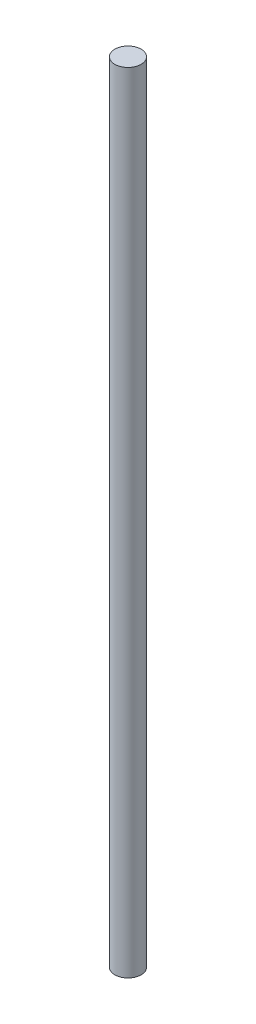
ISO-10303-21;
HEADER;
FILE_DESCRIPTION(('STEP AP214'),'2;1');
FILE_NAME('part.step','',(''),(''),'','','');
FILE_SCHEMA(('AUTOMOTIVE_DESIGN { 1 0 10303 214 1 1 1 1 }'));
ENDSEC;
DATA;
#1=APPLICATION_CONTEXT('core data for automotive mechanical design processes');
#2=APPLICATION_PROTOCOL_DEFINITION('international standard','automotive_design',2000,#1);
#3=PRODUCT_CONTEXT('',#1,'mechanical');
#4=PRODUCT('Part','Part','',(#3));
#5=PRODUCT_RELATED_PRODUCT_CATEGORY('part','',(#4));
#6=PRODUCT_DEFINITION_FORMATION('','',#4);
#7=PRODUCT_DEFINITION_CONTEXT('part definition',#1,'design');
#8=PRODUCT_DEFINITION('design','',#6,#7);
#9=PRODUCT_DEFINITION_SHAPE('','',#8);
#10=(LENGTH_UNIT() NAMED_UNIT(*) SI_UNIT(.MILLI.,.METRE.));
#11=(NAMED_UNIT(*) PLANE_ANGLE_UNIT() SI_UNIT($,.RADIAN.));
#12=(NAMED_UNIT(*) SI_UNIT($,.STERADIAN.) SOLID_ANGLE_UNIT());
#13=UNCERTAINTY_MEASURE_WITH_UNIT(LENGTH_MEASURE(1.E-05),#10,'distance_accuracy_value','');
#14=(GEOMETRIC_REPRESENTATION_CONTEXT(3) GLOBAL_UNCERTAINTY_ASSIGNED_CONTEXT((#13)) GLOBAL_UNIT_ASSIGNED_CONTEXT((#10,
#11,#12)) REPRESENTATION_CONTEXT('',''));
#15=CARTESIAN_POINT('',(0.,0.,0.));
#16=DIRECTION('',(0.,0.,1.));
#17=DIRECTION('',(1.,0.,0.));
#18=AXIS2_PLACEMENT_3D('',#15,#16,#17);
#19=CARTESIAN_POINT('',(0.,75.,0.));
#20=DIRECTION('',(0.,-1.,0.));
#21=DIRECTION('',(0.,0.,-1.));
#22=AXIS2_PLACEMENT_3D('',#19,#20,#21);
#23=CYLINDRICAL_SURFACE('',#22,1.25);
#24=CARTESIAN_POINT('',(0.,75.,0.));
#25=DIRECTION('',(0.,1.,0.));
#26=DIRECTION('',(0.,0.,1.));
#27=AXIS2_PLACEMENT_3D('',#24,#25,#26);
#28=CIRCLE('',#27,1.25);
#29=CARTESIAN_POINT('',(0.,75.,1.25));
#30=VERTEX_POINT('',#29);
#31=EDGE_CURVE('E10',#30,#30,#28,.T.);
#32=ORIENTED_EDGE('',*,*,#31,.F.);
#33=EDGE_LOOP('',(#32));
#34=FACE_BOUND('',#33,.T.);
#35=CARTESIAN_POINT('',(0.,0.,0.));
#36=DIRECTION('',(0.,1.,0.));
#37=DIRECTION('',(0.,0.,1.));
#38=AXIS2_PLACEMENT_3D('',#35,#36,#37);
#39=CIRCLE('',#38,1.25);
#40=CARTESIAN_POINT('',(0.,0.,1.25));
#41=VERTEX_POINT('',#40);
#42=EDGE_CURVE('E31',#41,#41,#39,.T.);
#43=ORIENTED_EDGE('',*,*,#42,.T.);
#44=EDGE_LOOP('',(#43));
#45=FACE_BOUND('',#44,.T.);
#46=ADVANCED_FACE('F28',(#34,#45),#23,.T.);
#47=CARTESIAN_POINT('',(0.,75.,0.));
#48=DIRECTION('',(0.,1.,0.));
#49=DIRECTION('',(0.,0.,1.));
#50=AXIS2_PLACEMENT_3D('',#47,#48,#49);
#51=PLANE('',#50);
#52=ORIENTED_EDGE('',*,*,#31,.T.);
#53=EDGE_LOOP('',(#52));
#54=FACE_BOUND('',#53,.T.);
#55=ADVANCED_FACE('F43',(#54),#51,.T.);
#56=CARTESIAN_POINT('',(0.,0.,0.));
#57=DIRECTION('',(0.,1.,0.));
#58=DIRECTION('',(0.,0.,1.));
#59=AXIS2_PLACEMENT_3D('',#56,#57,#58);
#60=PLANE('',#59);
#61=ORIENTED_EDGE('',*,*,#42,.F.);
#62=EDGE_LOOP('',(#61));
#63=FACE_BOUND('',#62,.T.);
#64=ADVANCED_FACE('F41',(#63),#60,.F.);
#65=CLOSED_SHELL('',(#46,#55,#64));
#66=MANIFOLD_SOLID_BREP('B2',#65);
#67=ADVANCED_BREP_SHAPE_REPRESENTATION('',(#18,#66),#14);
#68=SHAPE_DEFINITION_REPRESENTATION(#9,#67);
ENDSEC;
END-ISO-10303-21;
